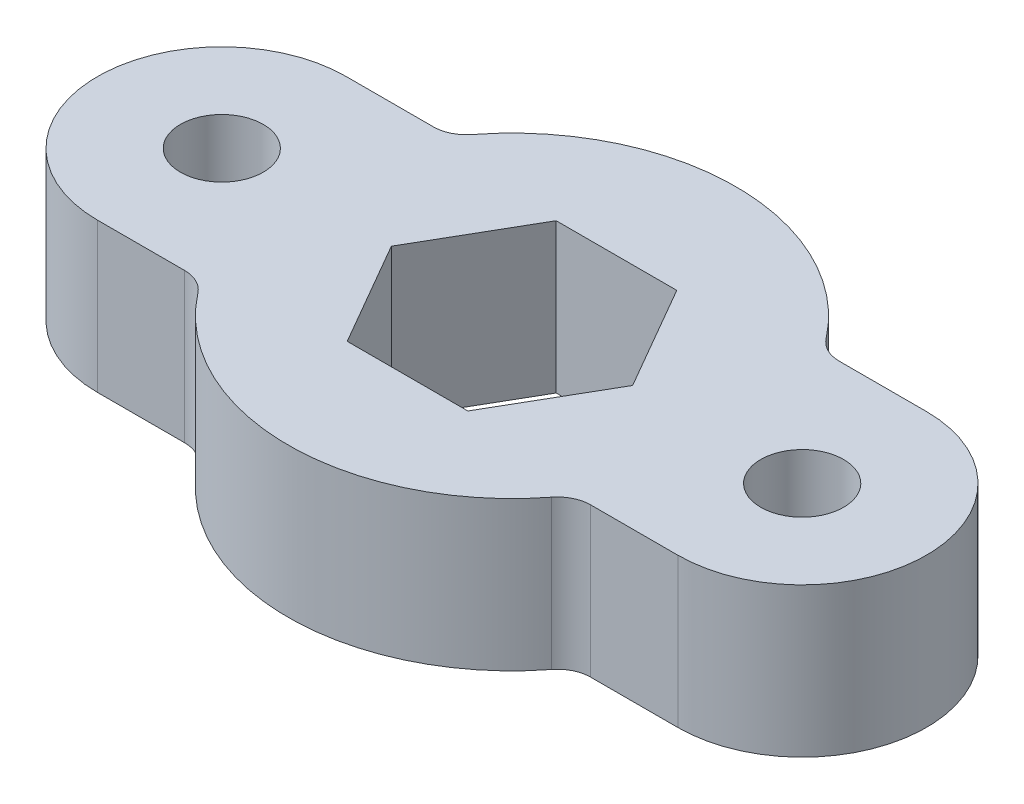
from build123d import *

# Parameters (mm, degrees)
SKETCH1_R           = 2.5
BOSS_EXTRUDE1_DEPTH = 9
FILLET1_R           = 2


with BuildPart() as part:
    # Sketch1 → Boss-Extrude1 (new body)
    with BuildSketch(Plane(origin=(0, 0, 0), x_dir=(1, 0, 0), z_dir=(0, 1, 0))):
        with BuildLine():
            Line((-17.5, 7.5), (-11.22497216, 7.5))
            ThreePointArc((-11.22497216, 7.5), (0, 13.5), (11.22497216, 7.5))
            Line((11.22497216, 7.5), (17.5, 7.5))
            ThreePointArc((17.5, 7.5), (25, 0), (17.5, -7.5))
            Line((17.5, -7.5), (11.22497216, -7.5))
            ThreePointArc((11.22497216, -7.5), (0, -13.5), (-11.22497216, -7.5))
            Line((-11.22497216, -7.5), (-17.5, -7.5))
            ThreePointArc((-17.5, -7.5), (-25, 0), (-17.5, 7.5))
        make_face()
        with Locations(Location((-17.5, 0, 0), (0, 0, 270))):
            Circle(SKETCH1_R, mode=Mode.SUBTRACT)
        with Locations(Location((17.5, 0, 0), (0, 0, 270))):
            Circle(SKETCH1_R, mode=Mode.SUBTRACT)
        Polygon((3.637306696, 6.3), (-3.637306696, 6.3), (-7.274613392, 0), (-3.637306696, -6.3), (3.637306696, -6.3), (7.274613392, 0), align=None, mode=Mode.SUBTRACT)
    extrude(amount=BOSS_EXTRUDE1_DEPTH)

    # Fillet1
    fillet1_edges = [part.edges().sort_by_distance(p)[0] for p in [
        (-11.22497216, 4.5, -7.5),
        (11.22497216, 4.5, -7.5),
        (11.22497216, 4.5, 7.5),
        (-11.22497216, 4.5, 7.5),
    ]]
    fillet(fillet1_edges, radius=FILLET1_R)


solid = part.part
